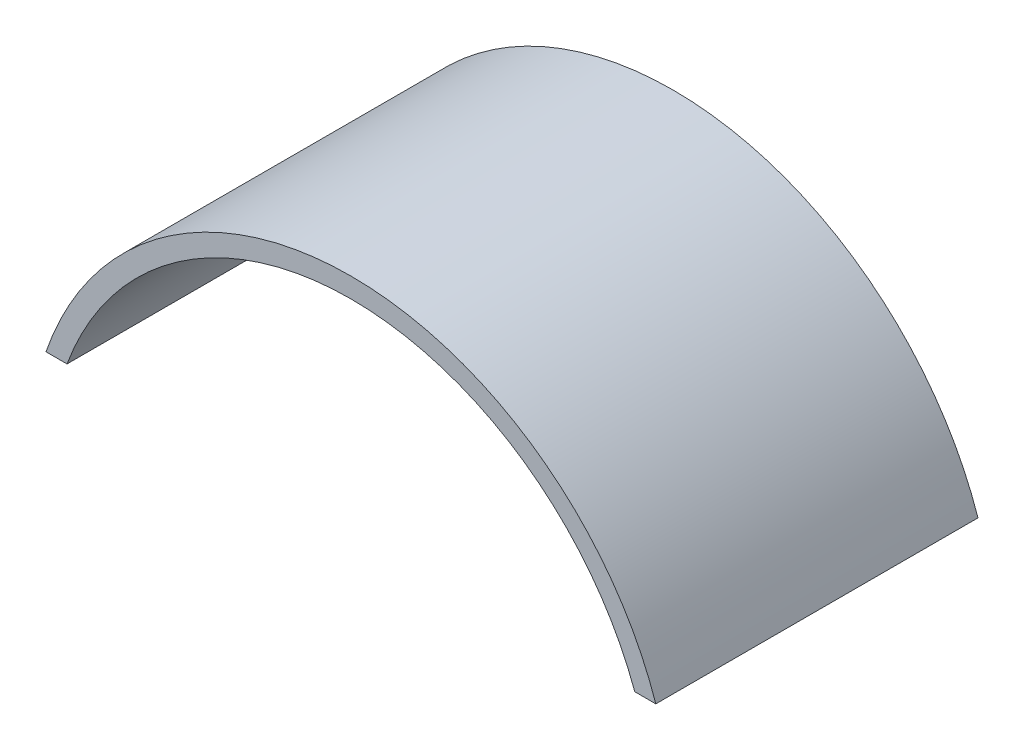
from build123d import *

# Parameters (mm, degrees)
EXTRUDE_1_DEPTH = 130


with BuildPart() as part:
    # Sketch 1 → Extrude 1 (new body)
    with BuildSketch(Plane.XY):
        with BuildLine():
            Line((-123.028451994, 42), (-114.542568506, 42))
            ThreePointArc((-114.542568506, 42), (0, 122), (114.542568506, 42))
            Line((114.542568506, 42), (123.028451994, 42))
            ThreePointArc((123.028451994, 42), (0, 130), (-123.028451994, 42))
        make_face()
    extrude(amount=EXTRUDE_1_DEPTH)


solid = part.part
